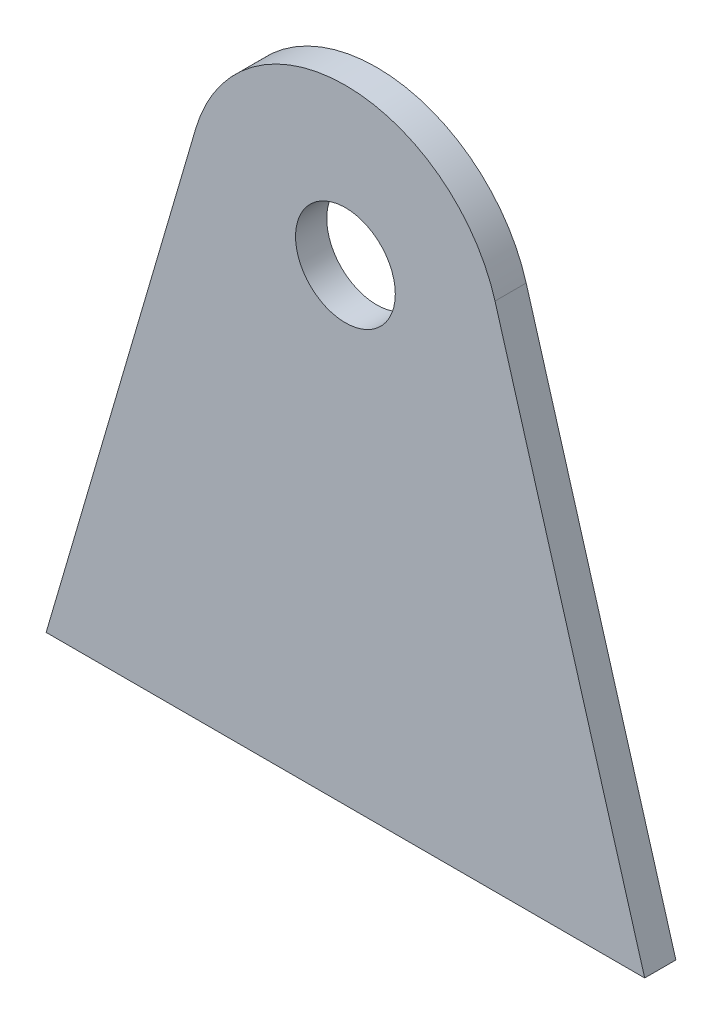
from build123d import *

# Parameters (mm, degrees)
ESQUISSE1_R      = 8
EXTRUSION1_DEPTH = 5


with BuildPart() as part:
    # Esquisse1 → Extrusion1 (new body)
    with BuildSketch(Plane.XY):
        with BuildLine():
            Line((-48, 0), (48, 0))
            Line((48, 0), (23.993436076, 82.022465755))
            ThreePointArc((23.993436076, 82.022465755), (0, 100), (-23.993436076, 82.022465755))
            Line((-23.993436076, 82.022465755), (-48, 0))
        make_face()
        with Locations((0, 75)):
            Circle(ESQUISSE1_R, mode=Mode.SUBTRACT)
    extrude(amount=EXTRUSION1_DEPTH)


solid = part.part
